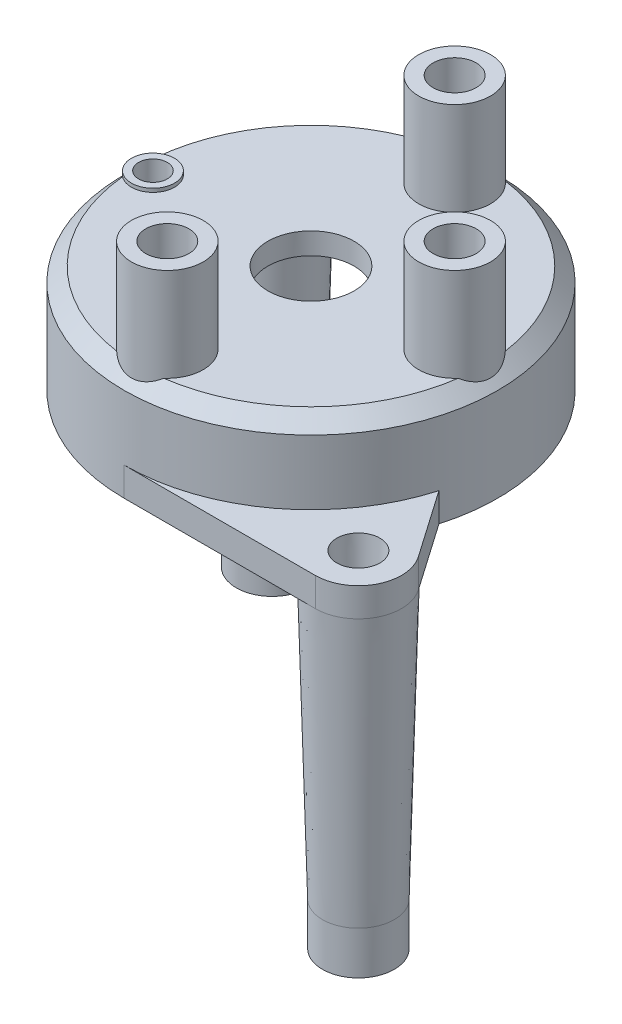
ISO-10303-21;
HEADER;
FILE_DESCRIPTION(('STEP AP214'),'2;1');
FILE_NAME('part.step','',(''),(''),'','','');
FILE_SCHEMA(('AUTOMOTIVE_DESIGN { 1 0 10303 214 1 1 1 1 }'));
ENDSEC;
DATA;
#1=APPLICATION_CONTEXT('core data for automotive mechanical design processes');
#2=APPLICATION_PROTOCOL_DEFINITION('international standard','automotive_design',2000,#1);
#3=PRODUCT_CONTEXT('',#1,'mechanical');
#4=PRODUCT('Part','Part','',(#3));
#5=PRODUCT_RELATED_PRODUCT_CATEGORY('part','',(#4));
#6=PRODUCT_DEFINITION_FORMATION('','',#4);
#7=PRODUCT_DEFINITION_CONTEXT('part definition',#1,'design');
#8=PRODUCT_DEFINITION('design','',#6,#7);
#9=PRODUCT_DEFINITION_SHAPE('','',#8);
#10=(LENGTH_UNIT() NAMED_UNIT(*) SI_UNIT(.MILLI.,.METRE.));
#11=(NAMED_UNIT(*) PLANE_ANGLE_UNIT() SI_UNIT($,.RADIAN.));
#12=(NAMED_UNIT(*) SI_UNIT($,.STERADIAN.) SOLID_ANGLE_UNIT());
#13=UNCERTAINTY_MEASURE_WITH_UNIT(LENGTH_MEASURE(1.E-05),#10,'distance_accuracy_value','');
#14=(GEOMETRIC_REPRESENTATION_CONTEXT(3) GLOBAL_UNCERTAINTY_ASSIGNED_CONTEXT((#13)) GLOBAL_UNIT_ASSIGNED_CONTEXT((#10,
#11,#12)) REPRESENTATION_CONTEXT('',''));
#15=CARTESIAN_POINT('',(0.,0.,0.));
#16=DIRECTION('',(0.,0.,1.));
#17=DIRECTION('',(1.,0.,0.));
#18=AXIS2_PLACEMENT_3D('',#15,#16,#17);
#19=CARTESIAN_POINT('',(0.321544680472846,-2.,-32.4831215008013));
#20=DIRECTION('',(0.,-1.,0.));
#21=DIRECTION('',(0.,0.,-1.));
#22=AXIS2_PLACEMENT_3D('',#19,#20,#21);
#23=PLANE('',#22);
#24=CARTESIAN_POINT('',(0.,-2.,0.));
#25=DIRECTION('',(0.,-1.,0.));
#26=DIRECTION('',(0.,0.,-1.));
#27=AXIS2_PLACEMENT_3D('',#24,#25,#26);
#28=CIRCLE('',#27,12.);
#29=CARTESIAN_POINT('',(0.,-2.,-12.));
#30=VERTEX_POINT('',#29);
#31=EDGE_CURVE('E146',#30,#30,#28,.T.);
#32=ORIENTED_EDGE('',*,*,#31,.F.);
#33=EDGE_LOOP('',(#32));
#34=FACE_BOUND('',#33,.T.);
#35=DIRECTION('',(-0.529109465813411,0.,-0.848553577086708));
#36=VECTOR('',#35,1.);
#37=CARTESIAN_POINT('',(-21.6946112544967,-2.,-18.7551061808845));
#38=LINE('',#37,#36);
#39=CARTESIAN_POINT('',(-12.4114396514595,-2.,-3.86732023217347));
#40=VERTEX_POINT('',#39);
#41=CARTESIAN_POINT('',(-15.2456607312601,-2.,-8.41267160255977));
#42=VERTEX_POINT('',#41);
#43=EDGE_CURVE('E174',#40,#42,#38,.T.);
#44=ORIENTED_EDGE('',*,*,#43,.T.);
#45=CARTESIAN_POINT('',(-12.7,-2.,-10.));
#46=DIRECTION('',(0.,-1.,0.));
#47=DIRECTION('',(0.,0.,-1.));
#48=AXIS2_PLACEMENT_3D('',#45,#46,#47);
#49=CIRCLE('',#48,2.9999999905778);
#50=CARTESIAN_POINT('',(-12.7,-2.,-12.9999999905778));
#51=VERTEX_POINT('',#50);
#52=EDGE_CURVE('E138',#51,#42,#49,.T.);
#53=ORIENTED_EDGE('',*,*,#52,.F.);
#54=DIRECTION('',(-1.,0.,0.));
#55=VECTOR('',#54,1.);
#56=CARTESIAN_POINT('',(0.321544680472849,-2.,-13.));
#57=LINE('',#56,#55);
#58=CARTESIAN_POINT('',(0.,-2.,-13.));
#59=VERTEX_POINT('',#58);
#60=EDGE_CURVE('E179',#59,#51,#57,.T.);
#61=ORIENTED_EDGE('',*,*,#60,.F.);
#62=CARTESIAN_POINT('',(0.,-2.,0.));
#63=DIRECTION('',(0.,-1.,0.));
#64=DIRECTION('',(0.,0.,-1.));
#65=AXIS2_PLACEMENT_3D('',#62,#63,#64);
#66=CIRCLE('',#65,13.);
#67=CARTESIAN_POINT('',(12.4950715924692,-2.,3.58792222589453));
#68=VERTEX_POINT('',#67);
#69=EDGE_CURVE('E176',#59,#68,#66,.T.);
#70=ORIENTED_EDGE('',*,*,#69,.T.);
#71=DIRECTION('',(0.570929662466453,0.,0.820998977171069));
#72=VECTOR('',#71,1.);
#73=CARTESIAN_POINT('',(-8.38069610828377,-2.,-26.4315093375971));
#74=LINE('',#73,#72);
#75=CARTESIAN_POINT('',(15.7629967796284,-2.,8.28721111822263));
#76=VERTEX_POINT('',#75);
#77=EDGE_CURVE('E525',#68,#76,#74,.T.);
#78=ORIENTED_EDGE('',*,*,#77,.T.);
#79=CARTESIAN_POINT('',(13.3,-2.,10.));
#80=DIRECTION('',(0.,-1.,0.));
#81=DIRECTION('',(0.,0.,-1.));
#82=AXIS2_PLACEMENT_3D('',#79,#80,#81);
#83=CIRCLE('',#82,2.999999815);
#84=CARTESIAN_POINT('',(13.3,-2.,13.));
#85=VERTEX_POINT('',#84);
#86=EDGE_CURVE('E288',#85,#76,#83,.T.);
#87=ORIENTED_EDGE('',*,*,#86,.F.);
#88=DIRECTION('',(-1.,0.,0.));
#89=VECTOR('',#88,1.);
#90=CARTESIAN_POINT('',(0.321544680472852,-2.,13.));
#91=LINE('',#90,#89);
#92=CARTESIAN_POINT('',(0.,-2.,13.));
#93=VERTEX_POINT('',#92);
#94=EDGE_CURVE('E175',#85,#93,#91,.T.);
#95=ORIENTED_EDGE('',*,*,#94,.T.);
#96=EDGE_CURVE('E172',#93,#40,#66,.T.);
#97=ORIENTED_EDGE('',*,*,#96,.T.);
#98=EDGE_LOOP('',(#44,#53,#61,#70,#78,#87,#95,#97));
#99=FACE_BOUND('',#98,.T.);
#100=ADVANCED_FACE('F28',(#34,#99),#23,.T.);
#101=CARTESIAN_POINT('',(0.,0.,-10.));
#102=DIRECTION('',(0.,1.,0.));
#103=DIRECTION('',(0.,0.,1.));
#104=AXIS2_PLACEMENT_3D('',#101,#102,#103);
#105=CYLINDRICAL_SURFACE('',#104,1.5);
#106=CARTESIAN_POINT('',(0.,12.,-10.));
#107=DIRECTION('',(0.,1.,0.));
#108=DIRECTION('',(0.,0.,1.));
#109=AXIS2_PLACEMENT_3D('',#106,#107,#108);
#110=CIRCLE('',#109,1.5);
#111=CARTESIAN_POINT('',(0.,12.,-8.5));
#112=VERTEX_POINT('',#111);
#113=EDGE_CURVE('E199',#112,#112,#110,.T.);
#114=ORIENTED_EDGE('',*,*,#113,.T.);
#115=EDGE_LOOP('',(#114));
#116=FACE_BOUND('',#115,.T.);
#117=CARTESIAN_POINT('',(0.,4.,-10.));
#118=DIRECTION('',(0.,-1.,0.));
#119=DIRECTION('',(0.,0.,-1.));
#120=AXIS2_PLACEMENT_3D('',#117,#118,#119);
#121=CIRCLE('',#120,1.5);
#122=CARTESIAN_POINT('',(0.,4.,-11.5));
#123=VERTEX_POINT('',#122);
#124=EDGE_CURVE('E160',#123,#123,#121,.F.);
#125=ORIENTED_EDGE('',*,*,#124,.F.);
#126=EDGE_LOOP('',(#125));
#127=FACE_BOUND('',#126,.T.);
#128=ADVANCED_FACE('F300',(#116,#127),#105,.F.);
#129=CARTESIAN_POINT('',(10.,0.,0.));
#130=DIRECTION('',(0.,1.,0.));
#131=DIRECTION('',(0.,0.,1.));
#132=AXIS2_PLACEMENT_3D('',#129,#130,#131);
#133=CYLINDRICAL_SURFACE('',#132,1.5);
#134=CARTESIAN_POINT('',(10.,12.,0.));
#135=DIRECTION('',(0.,1.,0.));
#136=DIRECTION('',(0.,0.,1.));
#137=AXIS2_PLACEMENT_3D('',#134,#135,#136);
#138=CIRCLE('',#137,1.5);
#139=CARTESIAN_POINT('',(10.,12.,1.50000000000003));
#140=VERTEX_POINT('',#139);
#141=EDGE_CURVE('E196',#140,#140,#138,.T.);
#142=ORIENTED_EDGE('',*,*,#141,.T.);
#143=EDGE_LOOP('',(#142));
#144=FACE_BOUND('',#143,.T.);
#145=CARTESIAN_POINT('',(10.,4.,0.));
#146=DIRECTION('',(0.,-1.,0.));
#147=DIRECTION('',(0.,0.,-1.));
#148=AXIS2_PLACEMENT_3D('',#145,#146,#147);
#149=CIRCLE('',#148,1.5);
#150=CARTESIAN_POINT('',(10.,4.,-1.49999999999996));
#151=VERTEX_POINT('',#150);
#152=EDGE_CURVE('E157',#151,#151,#149,.F.);
#153=ORIENTED_EDGE('',*,*,#152,.F.);
#154=EDGE_LOOP('',(#153));
#155=FACE_BOUND('',#154,.T.);
#156=ADVANCED_FACE('F303',(#144,#155),#133,.F.);
#157=CARTESIAN_POINT('',(0.,0.,10.));
#158=DIRECTION('',(0.,1.,0.));
#159=DIRECTION('',(0.,0.,1.));
#160=AXIS2_PLACEMENT_3D('',#157,#158,#159);
#161=CYLINDRICAL_SURFACE('',#160,1.5);
#162=CARTESIAN_POINT('',(0.,12.,10.));
#163=DIRECTION('',(0.,1.,0.));
#164=DIRECTION('',(0.,0.,1.));
#165=AXIS2_PLACEMENT_3D('',#162,#163,#164);
#166=CIRCLE('',#165,1.5);
#167=CARTESIAN_POINT('',(0.,12.,11.5));
#168=VERTEX_POINT('',#167);
#169=EDGE_CURVE('E193',#168,#168,#166,.T.);
#170=ORIENTED_EDGE('',*,*,#169,.T.);
#171=EDGE_LOOP('',(#170));
#172=FACE_BOUND('',#171,.T.);
#173=CARTESIAN_POINT('',(0.,4.,10.));
#174=DIRECTION('',(0.,-1.,0.));
#175=DIRECTION('',(0.,0.,-1.));
#176=AXIS2_PLACEMENT_3D('',#173,#174,#175);
#177=CIRCLE('',#176,1.5);
#178=CARTESIAN_POINT('',(0.,4.,8.5));
#179=VERTEX_POINT('',#178);
#180=EDGE_CURVE('E154',#179,#179,#177,.F.);
#181=ORIENTED_EDGE('',*,*,#180,.F.);
#182=EDGE_LOOP('',(#181));
#183=FACE_BOUND('',#182,.T.);
#184=ADVANCED_FACE('F307',(#172,#183),#161,.F.);
#185=CARTESIAN_POINT('',(-11.,0.,0.));
#186=DIRECTION('',(0.,1.,0.));
#187=DIRECTION('',(0.,0.,1.));
#188=AXIS2_PLACEMENT_3D('',#185,#186,#187);
#189=CYLINDRICAL_SURFACE('',#188,1.);
#190=CARTESIAN_POINT('',(-11.,5.75,0.));
#191=DIRECTION('',(0.,1.,0.));
#192=DIRECTION('',(0.,0.,1.));
#193=AXIS2_PLACEMENT_3D('',#190,#191,#192);
#194=CIRCLE('',#193,1.);
#195=CARTESIAN_POINT('',(-11.,5.75,1.));
#196=VERTEX_POINT('',#195);
#197=EDGE_CURVE('E191',#196,#196,#194,.T.);
#198=ORIENTED_EDGE('',*,*,#197,.T.);
#199=EDGE_LOOP('',(#198));
#200=FACE_BOUND('',#199,.T.);
#201=CARTESIAN_POINT('',(-11.,4.,0.));
#202=DIRECTION('',(0.,-1.,0.));
#203=DIRECTION('',(0.,0.,-1.));
#204=AXIS2_PLACEMENT_3D('',#201,#202,#203);
#205=CIRCLE('',#204,1.);
#206=CARTESIAN_POINT('',(-12.,4.,0.));
#207=VERTEX_POINT('',#206);
#208=EDGE_CURVE('E151',#207,#207,#205,.F.);
#209=ORIENTED_EDGE('',*,*,#208,.F.);
#210=EDGE_LOOP('',(#209));
#211=FACE_BOUND('',#210,.T.);
#212=ADVANCED_FACE('F311',(#200,#211),#189,.F.);
#213=CARTESIAN_POINT('',(0.,0.,0.));
#214=DIRECTION('',(0.,1.,0.));
#215=DIRECTION('',(0.,0.,1.));
#216=AXIS2_PLACEMENT_3D('',#213,#214,#215);
#217=CYLINDRICAL_SURFACE('',#216,3.);
#218=CARTESIAN_POINT('',(0.,5.5,0.));
#219=DIRECTION('',(0.,1.,0.));
#220=DIRECTION('',(0.,0.,1.));
#221=AXIS2_PLACEMENT_3D('',#218,#219,#220);
#222=CIRCLE('',#221,3.);
#223=CARTESIAN_POINT('',(0.,5.5,3.));
#224=VERTEX_POINT('',#223);
#225=EDGE_CURVE('E188',#224,#224,#222,.T.);
#226=ORIENTED_EDGE('',*,*,#225,.T.);
#227=EDGE_LOOP('',(#226));
#228=FACE_BOUND('',#227,.T.);
#229=CARTESIAN_POINT('',(0.,4.,0.));
#230=DIRECTION('',(0.,-1.,0.));
#231=DIRECTION('',(0.,0.,-1.));
#232=AXIS2_PLACEMENT_3D('',#229,#230,#231);
#233=CIRCLE('',#232,3.);
#234=CARTESIAN_POINT('',(0.,4.,-3.));
#235=VERTEX_POINT('',#234);
#236=EDGE_CURVE('E150',#235,#235,#233,.F.);
#237=ORIENTED_EDGE('',*,*,#236,.F.);
#238=EDGE_LOOP('',(#237));
#239=FACE_BOUND('',#238,.T.);
#240=ADVANCED_FACE('F315',(#228,#239),#217,.F.);
#241=CARTESIAN_POINT('',(0.,5.5,0.));
#242=DIRECTION('',(0.,1.,0.));
#243=DIRECTION('',(0.,0.,1.));
#244=AXIS2_PLACEMENT_3D('',#241,#242,#243);
#245=PLANE('',#244);
#246=ORIENTED_EDGE('',*,*,#225,.F.);
#247=EDGE_LOOP('',(#246));
#248=FACE_BOUND('',#247,.T.);
#249=CARTESIAN_POINT('',(0.,5.5,0.));
#250=DIRECTION('',(0.,1.,0.));
#251=DIRECTION('',(0.,0.,1.));
#252=AXIS2_PLACEMENT_3D('',#249,#250,#251);
#253=CIRCLE('',#252,12.);
#254=CARTESIAN_POINT('',(-1.63931197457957,5.5,-11.8875));
#255=VERTEX_POINT('',#254);
#256=CARTESIAN_POINT('',(-11.9431818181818,5.5,-1.16636531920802));
#257=VERTEX_POINT('',#256);
#258=EDGE_CURVE('E231',#255,#257,#253,.T.);
#259=ORIENTED_EDGE('',*,*,#258,.T.);
#260=CARTESIAN_POINT('',(-11.,5.5,0.));
#261=DIRECTION('',(0.,1.,0.));
#262=DIRECTION('',(0.,0.,1.));
#263=AXIS2_PLACEMENT_3D('',#260,#261,#262);
#264=CIRCLE('',#263,1.5);
#265=CARTESIAN_POINT('',(-11.9431818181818,5.5,1.16636531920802));
#266=VERTEX_POINT('',#265);
#267=EDGE_CURVE('E205',#257,#266,#264,.F.);
#268=ORIENTED_EDGE('',*,*,#267,.T.);
#269=CARTESIAN_POINT('',(-1.63931197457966,5.5,11.8875));
#270=VERTEX_POINT('',#269);
#271=EDGE_CURVE('E235',#266,#270,#253,.T.);
#272=ORIENTED_EDGE('',*,*,#271,.T.);
#273=CARTESIAN_POINT('',(0.,5.5,10.));
#274=DIRECTION('',(0.,1.,0.));
#275=DIRECTION('',(0.,0.,1.));
#276=AXIS2_PLACEMENT_3D('',#273,#274,#275);
#277=CIRCLE('',#276,2.5);
#278=CARTESIAN_POINT('',(1.63931197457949,5.5,11.8875));
#279=VERTEX_POINT('',#278);
#280=EDGE_CURVE('E211',#270,#279,#277,.F.);
#281=ORIENTED_EDGE('',*,*,#280,.T.);
#282=CARTESIAN_POINT('',(11.8875,5.5,1.63931197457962));
#283=VERTEX_POINT('',#282);
#284=EDGE_CURVE('E576',#279,#283,#253,.T.);
#285=ORIENTED_EDGE('',*,*,#284,.T.);
#286=CARTESIAN_POINT('',(10.,5.5,0.));
#287=DIRECTION('',(0.,1.,0.));
#288=DIRECTION('',(0.,0.,1.));
#289=AXIS2_PLACEMENT_3D('',#286,#287,#288);
#290=CIRCLE('',#289,2.5);
#291=CARTESIAN_POINT('',(11.8875,5.5,-1.63931197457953));
#292=VERTEX_POINT('',#291);
#293=EDGE_CURVE('E217',#283,#292,#290,.F.);
#294=ORIENTED_EDGE('',*,*,#293,.T.);
#295=CARTESIAN_POINT('',(1.63931197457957,5.5,-11.8875));
#296=VERTEX_POINT('',#295);
#297=EDGE_CURVE('E229',#292,#296,#253,.T.);
#298=ORIENTED_EDGE('',*,*,#297,.T.);
#299=CARTESIAN_POINT('',(0.,5.5,-10.));
#300=DIRECTION('',(0.,1.,0.));
#301=DIRECTION('',(0.,0.,1.));
#302=AXIS2_PLACEMENT_3D('',#299,#300,#301);
#303=CIRCLE('',#302,2.5);
#304=EDGE_CURVE('E223',#296,#255,#303,.F.);
#305=ORIENTED_EDGE('',*,*,#304,.T.);
#306=EDGE_LOOP('',(#259,#268,#272,#281,#285,#294,#298,#305));
#307=FACE_BOUND('',#306,.T.);
#308=ADVANCED_FACE('F30',(#248,#307),#245,.T.);
#309=CARTESIAN_POINT('',(0.,4.50000000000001,0.));
#310=DIRECTION('',(0.,-1.,0.));
#311=DIRECTION('',(0.,0.,-1.));
#312=AXIS2_PLACEMENT_3D('',#309,#310,#311);
#313=CONICAL_SURFACE('',#312,13.,0.785398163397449);
#314=CARTESIAN_POINT('',(0.,4.50000000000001,0.));
#315=DIRECTION('',(0.,1.,0.));
#316=DIRECTION('',(0.,0.,1.));
#317=AXIS2_PLACEMENT_3D('',#314,#315,#316);
#318=CIRCLE('',#317,13.);
#319=CARTESIAN_POINT('',(0.,4.50000000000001,13.));
#320=VERTEX_POINT('',#319);
#321=EDGE_CURVE('E226',#320,#320,#318,.F.);
#322=ORIENTED_EDGE('',*,*,#321,.F.);
#323=EDGE_LOOP('',(#322));
#324=FACE_BOUND('',#323,.T.);
#325=ORIENTED_EDGE('',*,*,#271,.F.);
#326=CARTESIAN_POINT('',(-11.9429636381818,5.5002,1.1665417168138));
#327=CARTESIAN_POINT('',(-12.0011356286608,5.44686224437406,1.11954820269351));
#328=CARTESIAN_POINT('',(-12.0573373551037,5.39571185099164,1.06688408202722));
#329=CARTESIAN_POINT('',(-12.1636178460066,5.2995143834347,0.949885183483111));
#330=CARTESIAN_POINT('',(-12.2136437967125,5.25451963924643,0.885460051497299));
#331=CARTESIAN_POINT('',(-12.2954715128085,5.18125581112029,0.75911008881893));
#332=CARTESIAN_POINT('',(-12.3289231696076,5.15143718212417,0.699174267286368));
#333=CARTESIAN_POINT('',(-12.388039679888,5.09888877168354,0.572876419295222));
#334=CARTESIAN_POINT('',(-12.413726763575,5.07613874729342,0.506533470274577));
#335=CARTESIAN_POINT('',(-12.4559499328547,5.03881002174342,0.368084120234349));
#336=CARTESIAN_POINT('',(-12.4724052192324,5.02430345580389,0.295932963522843));
#337=CARTESIAN_POINT('',(-12.4944631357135,5.00486941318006,0.14869291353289));
#338=CARTESIAN_POINT('',(-12.5000676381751,4.99994028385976,0.0736045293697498));
#339=CARTESIAN_POINT('',(-12.4999397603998,5.00005318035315,-0.0668397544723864));
#340=CARTESIAN_POINT('',(-12.4955737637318,5.00389342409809,-0.13220433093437));
#341=CARTESIAN_POINT('',(-12.4785523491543,5.01888597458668,-0.260954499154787));
#342=CARTESIAN_POINT('',(-12.4658990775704,5.03003638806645,-0.324340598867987));
#343=CARTESIAN_POINT('',(-12.4333022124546,5.05882439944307,-0.446783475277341));
#344=CARTESIAN_POINT('',(-12.4134465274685,5.07638378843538,-0.505882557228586));
#345=CARTESIAN_POINT('',(-12.3674682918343,5.11716035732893,-0.619511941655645));
#346=CARTESIAN_POINT('',(-12.3413409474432,5.1403818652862,-0.67403870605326));
#347=CARTESIAN_POINT('',(-12.2726876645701,5.20161018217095,-0.798166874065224));
#348=CARTESIAN_POINT('',(-12.227743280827,5.2418487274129,-0.8653329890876));
#349=CARTESIAN_POINT('',(-12.1306156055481,5.32932013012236,-0.988890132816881));
#350=CARTESIAN_POINT('',(-12.0784281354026,5.37655702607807,-1.04527489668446));
#351=CARTESIAN_POINT('',(-11.997352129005,5.45042157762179,-1.12097633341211));
#352=CARTESIAN_POINT('',(-11.9703877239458,5.47505939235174,-1.14437194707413));
#353=CARTESIAN_POINT('',(-11.9429636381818,5.5002,-1.16654171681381));
#354=B_SPLINE_CURVE_WITH_KNOTS('',3,(#326,#327,#328,#329,#330,#331,#332,#333,#334,#335,#336,
#337,#338,#339,#340,#341,#342,#343,#344,#345,#346,#347,#348,#349,#350,#351,#352,#353),
.UNSPECIFIED.,.F.,.F.,(4,2,2,2,2,2,2,2,2,2,2,2,2,4),(0.,0.275959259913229,0.554135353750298,
0.777738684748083,1.00069563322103,1.22557467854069,1.45041491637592,1.64631462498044,
1.84216361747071,2.03569847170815,2.22938172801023,2.49874850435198,2.76827133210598,
2.89827049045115),.UNSPECIFIED.);
#355=EDGE_CURVE('E282',#266,#257,#354,.T.);
#356=ORIENTED_EDGE('',*,*,#355,.T.);
#357=ORIENTED_EDGE('',*,*,#258,.F.);
#358=CARTESIAN_POINT('',(-1.63958826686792,5.5002,-11.887260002));
#359=CARTESIAN_POINT('',(-1.59621088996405,5.46879855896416,-11.9249406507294));
#360=CARTESIAN_POINT('',(-1.55111146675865,5.43845625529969,-11.9614992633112));
#361=CARTESIAN_POINT('',(-1.45745940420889,5.38009839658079,-12.0320582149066));
#362=CARTESIAN_POINT('',(-1.40890375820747,5.35208491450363,-12.0660562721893));
#363=CARTESIAN_POINT('',(-1.25756913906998,5.27161836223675,-12.1640215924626));
#364=CARTESIAN_POINT('',(-1.14963184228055,5.22311326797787,-12.2235096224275));
#365=CARTESIAN_POINT('',(-0.921329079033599,5.13874775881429,-12.3274376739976));
#366=CARTESIAN_POINT('',(-0.800900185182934,5.1029564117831,-12.3717954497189));
#367=CARTESIAN_POINT('',(-0.551658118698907,5.0466242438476,-12.4417880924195));
#368=CARTESIAN_POINT('',(-0.42287475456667,5.02603213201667,-12.4674859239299));
#369=CARTESIAN_POINT('',(-0.175639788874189,5.00272910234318,-12.4965831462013));
#370=CARTESIAN_POINT('',(-0.0575961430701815,4.99831074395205,-12.5021115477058));
#371=CARTESIAN_POINT('',(0.177889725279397,5.00284709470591,-12.4964411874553));
#372=CARTESIAN_POINT('',(0.29533170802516,5.01180677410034,-12.4852362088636));
#373=CARTESIAN_POINT('',(0.518343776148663,5.04156661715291,-12.4481182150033));
#374=CARTESIAN_POINT('',(0.624191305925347,5.06156696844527,-12.4231990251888));
#375=CARTESIAN_POINT('',(0.829537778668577,5.11183306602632,-12.3608026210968));
#376=CARTESIAN_POINT('',(0.929034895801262,5.14210174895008,-12.3233218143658));
#377=CARTESIAN_POINT('',(1.12639245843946,5.21404308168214,-12.2346679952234));
#378=CARTESIAN_POINT('',(1.22367251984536,5.25635554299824,-12.1827321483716));
#379=CARTESIAN_POINT('',(1.40751586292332,5.349638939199,-12.0689554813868));
#380=CARTESIAN_POINT('',(1.49408866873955,5.40060208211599,-12.0071235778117));
#381=CARTESIAN_POINT('',(1.59696050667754,5.46988410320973,-11.923673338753));
#382=CARTESIAN_POINT('',(1.6184849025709,5.48491981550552,-11.9055956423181));
#383=CARTESIAN_POINT('',(1.63958826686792,5.5002,-11.887260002));
#384=B_SPLINE_CURVE_WITH_KNOTS('',3,(#358,#359,#360,#361,#362,#363,#364,#365,#366,#367,#368,
#369,#370,#371,#372,#373,#374,#375,#376,#377,#378,#379,#380,#381,#382,#383),.UNSPECIFIED.,.F.,
.F.,(4,2,2,2,2,2,2,2,2,2,2,2,4),(0.,0.196358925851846,0.392890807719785,0.788258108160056,
1.18574153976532,1.58187742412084,1.93474438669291,2.28774248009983,2.61800406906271,
2.94836018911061,3.30137612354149,3.65407575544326,3.74968333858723),.UNSPECIFIED.);
#385=EDGE_CURVE('E234',#255,#296,#384,.T.);
#386=ORIENTED_EDGE('',*,*,#385,.T.);
#387=ORIENTED_EDGE('',*,*,#297,.F.);
#388=CARTESIAN_POINT('',(11.887260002,5.5002,-1.63958826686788));
#389=CARTESIAN_POINT('',(11.9249406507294,5.46879855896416,-1.59621088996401));
#390=CARTESIAN_POINT('',(11.9614992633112,5.43845625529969,-1.55111146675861));
#391=CARTESIAN_POINT('',(12.0320582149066,5.38009839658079,-1.45745940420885));
#392=CARTESIAN_POINT('',(12.0660562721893,5.35208491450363,-1.40890375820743));
#393=CARTESIAN_POINT('',(12.1640215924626,5.27161836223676,-1.25756913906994));
#394=CARTESIAN_POINT('',(12.2235096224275,5.22311326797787,-1.1496318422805));
#395=CARTESIAN_POINT('',(12.3274376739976,5.13874775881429,-0.921329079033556));
#396=CARTESIAN_POINT('',(12.3717954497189,5.1029564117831,-0.800900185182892));
#397=CARTESIAN_POINT('',(12.4417880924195,5.0466242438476,-0.551658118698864));
#398=CARTESIAN_POINT('',(12.4674859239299,5.02603213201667,-0.422874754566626));
#399=CARTESIAN_POINT('',(12.4965831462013,5.00272910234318,-0.175639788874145));
#400=CARTESIAN_POINT('',(12.5021115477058,4.99831074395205,-0.0575961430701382));
#401=CARTESIAN_POINT('',(12.4964411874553,5.00284709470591,0.177889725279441));
#402=CARTESIAN_POINT('',(12.4852362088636,5.01180677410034,0.295331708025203));
#403=CARTESIAN_POINT('',(12.4481182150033,5.0415666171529,0.518343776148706));
#404=CARTESIAN_POINT('',(12.4231990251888,5.06156696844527,0.624191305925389));
#405=CARTESIAN_POINT('',(12.3608026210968,5.11183306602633,0.829537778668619));
#406=CARTESIAN_POINT('',(12.3233218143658,5.14210174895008,0.929034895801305));
#407=CARTESIAN_POINT('',(12.2346679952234,5.21404308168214,1.1263924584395));
#408=CARTESIAN_POINT('',(12.1827321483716,5.25635554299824,1.2236725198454));
#409=CARTESIAN_POINT('',(12.0689554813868,5.349638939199,1.40751586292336));
#410=CARTESIAN_POINT('',(12.0071235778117,5.40060208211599,1.4940886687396));
#411=CARTESIAN_POINT('',(11.923673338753,5.46988410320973,1.59696050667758));
#412=CARTESIAN_POINT('',(11.9055956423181,5.48491981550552,1.61848490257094));
#413=CARTESIAN_POINT('',(11.887260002,5.5002,1.63958826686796));
#414=B_SPLINE_CURVE_WITH_KNOTS('',3,(#388,#389,#390,#391,#392,#393,#394,#395,#396,#397,#398,
#399,#400,#401,#402,#403,#404,#405,#406,#407,#408,#409,#410,#411,#412,#413),.UNSPECIFIED.,.F.,
.F.,(4,2,2,2,2,2,2,2,2,2,2,2,4),(0.,0.196358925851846,0.392890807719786,0.788258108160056,
1.18574153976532,1.58187742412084,1.93474438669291,2.28774248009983,2.61800406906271,
2.94836018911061,3.30137612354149,3.65407575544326,3.74968333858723),.UNSPECIFIED.);
#415=EDGE_CURVE('E243',#292,#283,#414,.T.);
#416=ORIENTED_EDGE('',*,*,#415,.T.);
#417=ORIENTED_EDGE('',*,*,#284,.F.);
#418=CARTESIAN_POINT('',(1.63958826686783,5.5002,11.887260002));
#419=CARTESIAN_POINT('',(1.59621088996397,5.46879855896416,11.9249406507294));
#420=CARTESIAN_POINT('',(1.55111146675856,5.43845625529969,11.9614992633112));
#421=CARTESIAN_POINT('',(1.45745940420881,5.38009839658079,12.0320582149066));
#422=CARTESIAN_POINT('',(1.40890375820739,5.35208491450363,12.0660562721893));
#423=CARTESIAN_POINT('',(1.2575691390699,5.27161836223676,12.1640215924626));
#424=CARTESIAN_POINT('',(1.14963184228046,5.22311326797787,12.2235096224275));
#425=CARTESIAN_POINT('',(0.921329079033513,5.13874775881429,12.3274376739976));
#426=CARTESIAN_POINT('',(0.800900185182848,5.1029564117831,12.3717954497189));
#427=CARTESIAN_POINT('',(0.551658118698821,5.0466242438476,12.4417880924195));
#428=CARTESIAN_POINT('',(0.422874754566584,5.02603213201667,12.4674859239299));
#429=CARTESIAN_POINT('',(0.175639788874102,5.00272910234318,12.4965831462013));
#430=CARTESIAN_POINT('',(0.0575961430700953,4.99831074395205,12.5021115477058));
#431=CARTESIAN_POINT('',(-0.177889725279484,5.00284709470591,12.4964411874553));
#432=CARTESIAN_POINT('',(-0.295331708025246,5.01180677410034,12.4852362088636));
#433=CARTESIAN_POINT('',(-0.51834377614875,5.04156661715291,12.4481182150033));
#434=CARTESIAN_POINT('',(-0.624191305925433,5.06156696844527,12.4231990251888));
#435=CARTESIAN_POINT('',(-0.829537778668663,5.11183306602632,12.3608026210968));
#436=CARTESIAN_POINT('',(-0.929034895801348,5.14210174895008,12.3233218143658));
#437=CARTESIAN_POINT('',(-1.12639245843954,5.21404308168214,12.2346679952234));
#438=CARTESIAN_POINT('',(-1.22367251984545,5.25635554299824,12.1827321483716));
#439=CARTESIAN_POINT('',(-1.40751586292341,5.349638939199,12.0689554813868));
#440=CARTESIAN_POINT('',(-1.49408866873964,5.40060208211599,12.0071235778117));
#441=CARTESIAN_POINT('',(-1.59696050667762,5.46988410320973,11.923673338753));
#442=CARTESIAN_POINT('',(-1.61848490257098,5.48491981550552,11.9055956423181));
#443=CARTESIAN_POINT('',(-1.639588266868,5.5002,11.887260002));
#444=B_SPLINE_CURVE_WITH_KNOTS('',3,(#418,#419,#420,#421,#422,#423,#424,#425,#426,#427,#428,
#429,#430,#431,#432,#433,#434,#435,#436,#437,#438,#439,#440,#441,#442,#443),.UNSPECIFIED.,.F.,
.F.,(4,2,2,2,2,2,2,2,2,2,2,2,4),(0.,0.196358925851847,0.392890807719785,0.788258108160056,
1.18574153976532,1.58187742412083,1.93474438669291,2.28774248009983,2.61800406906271,
2.94836018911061,3.30137612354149,3.65407575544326,3.74968333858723),.UNSPECIFIED.);
#445=EDGE_CURVE('E276',#279,#270,#444,.T.);
#446=ORIENTED_EDGE('',*,*,#445,.T.);
#447=EDGE_LOOP('',(#325,#356,#357,#386,#387,#416,#417,#446));
#448=FACE_BOUND('',#447,.T.);
#449=ADVANCED_FACE('F249',(#324,#448),#313,.T.);
#450=CARTESIAN_POINT('',(0.,0.,0.));
#451=DIRECTION('',(0.,-1.,0.));
#452=DIRECTION('',(0.,0.,-1.));
#453=AXIS2_PLACEMENT_3D('',#450,#451,#452);
#454=CYLINDRICAL_SURFACE('',#453,13.);
#455=ORIENTED_EDGE('',*,*,#321,.T.);
#456=EDGE_LOOP('',(#455));
#457=FACE_BOUND('',#456,.T.);
#458=CARTESIAN_POINT('',(0.,0.,0.));
#459=DIRECTION('',(0.,-1.,0.));
#460=DIRECTION('',(0.,0.,-1.));
#461=AXIS2_PLACEMENT_3D('',#458,#459,#460);
#462=CIRCLE('',#461,13.);
#463=CARTESIAN_POINT('',(12.4950715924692,0.,3.58792222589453));
#464=VERTEX_POINT('',#463);
#465=CARTESIAN_POINT('',(0.,0.,13.));
#466=VERTEX_POINT('',#465);
#467=EDGE_CURVE('E230',#464,#466,#462,.T.);
#468=ORIENTED_EDGE('',*,*,#467,.F.);
#469=DIRECTION('',(0.,1.,0.));
#470=VECTOR('',#469,1.);
#471=CARTESIAN_POINT('',(12.4950715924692,-2.,3.58792222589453));
#472=LINE('',#471,#470);
#473=EDGE_CURVE('E501',#68,#464,#472,.T.);
#474=ORIENTED_EDGE('',*,*,#473,.F.);
#475=ORIENTED_EDGE('',*,*,#69,.F.);
#476=DIRECTION('',(0.,1.,0.));
#477=VECTOR('',#476,1.);
#478=CARTESIAN_POINT('',(0.,-2.,-13.));
#479=LINE('',#478,#477);
#480=CARTESIAN_POINT('',(0.,0.,-13.));
#481=VERTEX_POINT('',#480);
#482=EDGE_CURVE('E184',#59,#481,#479,.T.);
#483=ORIENTED_EDGE('',*,*,#482,.T.);
#484=CARTESIAN_POINT('',(-12.4114396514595,0.,-3.86732023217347));
#485=VERTEX_POINT('',#484);
#486=EDGE_CURVE('E48',#485,#481,#462,.T.);
#487=ORIENTED_EDGE('',*,*,#486,.F.);
#488=DIRECTION('',(0.,1.,0.));
#489=VECTOR('',#488,1.);
#490=CARTESIAN_POINT('',(-12.4114396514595,-2.,-3.86732023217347));
#491=LINE('',#490,#489);
#492=EDGE_CURVE('E187',#40,#485,#491,.T.);
#493=ORIENTED_EDGE('',*,*,#492,.F.);
#494=ORIENTED_EDGE('',*,*,#96,.F.);
#495=DIRECTION('',(0.,1.,0.));
#496=VECTOR('',#495,1.);
#497=CARTESIAN_POINT('',(0.,-2.,13.));
#498=LINE('',#497,#496);
#499=EDGE_CURVE('E495',#93,#466,#498,.T.);
#500=ORIENTED_EDGE('',*,*,#499,.T.);
#501=EDGE_LOOP('',(#468,#474,#475,#483,#487,#493,#494,#500));
#502=FACE_BOUND('',#501,.T.);
#503=ADVANCED_FACE('F256',(#457,#502),#454,.T.);
#504=CARTESIAN_POINT('',(0.,12.,-10.));
#505=DIRECTION('',(0.,-1.,0.));
#506=DIRECTION('',(0.,0.,-1.));
#507=AXIS2_PLACEMENT_3D('',#504,#505,#506);
#508=CYLINDRICAL_SURFACE('',#507,2.5);
#509=ORIENTED_EDGE('',*,*,#304,.F.);
#510=ORIENTED_EDGE('',*,*,#385,.F.);
#511=EDGE_LOOP('',(#509,#510));
#512=FACE_BOUND('',#511,.T.);
#513=CARTESIAN_POINT('',(0.,12.,-10.));
#514=DIRECTION('',(0.,1.,0.));
#515=DIRECTION('',(0.,0.,1.));
#516=AXIS2_PLACEMENT_3D('',#513,#514,#515);
#517=CIRCLE('',#516,2.5);
#518=CARTESIAN_POINT('',(0.,12.,-7.5));
#519=VERTEX_POINT('',#518);
#520=EDGE_CURVE('E220',#519,#519,#517,.T.);
#521=ORIENTED_EDGE('',*,*,#520,.F.);
#522=EDGE_LOOP('',(#521));
#523=FACE_BOUND('',#522,.T.);
#524=ADVANCED_FACE('F251',(#512,#523),#508,.T.);
#525=CARTESIAN_POINT('',(0.,12.,-10.));
#526=DIRECTION('',(0.,1.,0.));
#527=DIRECTION('',(0.,0.,1.));
#528=AXIS2_PLACEMENT_3D('',#525,#526,#527);
#529=PLANE('',#528);
#530=ORIENTED_EDGE('',*,*,#113,.F.);
#531=EDGE_LOOP('',(#530));
#532=FACE_BOUND('',#531,.T.);
#533=ORIENTED_EDGE('',*,*,#520,.T.);
#534=EDGE_LOOP('',(#533));
#535=FACE_BOUND('',#534,.T.);
#536=ADVANCED_FACE('F255',(#532,#535),#529,.T.);
#537=CARTESIAN_POINT('',(10.,12.,0.));
#538=DIRECTION('',(0.,-1.,0.));
#539=DIRECTION('',(0.,0.,-1.));
#540=AXIS2_PLACEMENT_3D('',#537,#538,#539);
#541=CYLINDRICAL_SURFACE('',#540,2.5);
#542=ORIENTED_EDGE('',*,*,#293,.F.);
#543=ORIENTED_EDGE('',*,*,#415,.F.);
#544=EDGE_LOOP('',(#542,#543));
#545=FACE_BOUND('',#544,.T.);
#546=CARTESIAN_POINT('',(10.,12.,0.));
#547=DIRECTION('',(0.,1.,0.));
#548=DIRECTION('',(0.,0.,1.));
#549=AXIS2_PLACEMENT_3D('',#546,#547,#548);
#550=CIRCLE('',#549,2.5);
#551=CARTESIAN_POINT('',(10.,12.,2.50000000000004));
#552=VERTEX_POINT('',#551);
#553=EDGE_CURVE('E214',#552,#552,#550,.T.);
#554=ORIENTED_EDGE('',*,*,#553,.F.);
#555=EDGE_LOOP('',(#554));
#556=FACE_BOUND('',#555,.T.);
#557=ADVANCED_FACE('F259',(#545,#556),#541,.T.);
#558=CARTESIAN_POINT('',(10.,12.,0.));
#559=DIRECTION('',(0.,1.,0.));
#560=DIRECTION('',(0.,0.,1.));
#561=AXIS2_PLACEMENT_3D('',#558,#559,#560);
#562=PLANE('',#561);
#563=ORIENTED_EDGE('',*,*,#141,.F.);
#564=EDGE_LOOP('',(#563));
#565=FACE_BOUND('',#564,.T.);
#566=ORIENTED_EDGE('',*,*,#553,.T.);
#567=EDGE_LOOP('',(#566));
#568=FACE_BOUND('',#567,.T.);
#569=ADVANCED_FACE('F264',(#565,#568),#562,.T.);
#570=CARTESIAN_POINT('',(0.,12.,10.));
#571=DIRECTION('',(0.,-1.,0.));
#572=DIRECTION('',(0.,0.,-1.));
#573=AXIS2_PLACEMENT_3D('',#570,#571,#572);
#574=CYLINDRICAL_SURFACE('',#573,2.5);
#575=ORIENTED_EDGE('',*,*,#280,.F.);
#576=ORIENTED_EDGE('',*,*,#445,.F.);
#577=EDGE_LOOP('',(#575,#576));
#578=FACE_BOUND('',#577,.T.);
#579=CARTESIAN_POINT('',(0.,12.,10.));
#580=DIRECTION('',(0.,1.,0.));
#581=DIRECTION('',(0.,0.,1.));
#582=AXIS2_PLACEMENT_3D('',#579,#580,#581);
#583=CIRCLE('',#582,2.5);
#584=CARTESIAN_POINT('',(0.,12.,12.5));
#585=VERTEX_POINT('',#584);
#586=EDGE_CURVE('E208',#585,#585,#583,.T.);
#587=ORIENTED_EDGE('',*,*,#586,.F.);
#588=EDGE_LOOP('',(#587));
#589=FACE_BOUND('',#588,.T.);
#590=ADVANCED_FACE('F268',(#578,#589),#574,.T.);
#591=CARTESIAN_POINT('',(0.,12.,10.));
#592=DIRECTION('',(0.,1.,0.));
#593=DIRECTION('',(0.,0.,1.));
#594=AXIS2_PLACEMENT_3D('',#591,#592,#593);
#595=PLANE('',#594);
#596=ORIENTED_EDGE('',*,*,#169,.F.);
#597=EDGE_LOOP('',(#596));
#598=FACE_BOUND('',#597,.T.);
#599=ORIENTED_EDGE('',*,*,#586,.T.);
#600=EDGE_LOOP('',(#599));
#601=FACE_BOUND('',#600,.T.);
#602=ADVANCED_FACE('F273',(#598,#601),#595,.T.);
#603=CARTESIAN_POINT('',(-11.,5.75,0.));
#604=DIRECTION('',(0.,-1.,0.));
#605=DIRECTION('',(0.,0.,-1.));
#606=AXIS2_PLACEMENT_3D('',#603,#604,#605);
#607=CYLINDRICAL_SURFACE('',#606,1.5);
#608=ORIENTED_EDGE('',*,*,#267,.F.);
#609=ORIENTED_EDGE('',*,*,#355,.F.);
#610=EDGE_LOOP('',(#608,#609));
#611=FACE_BOUND('',#610,.T.);
#612=CARTESIAN_POINT('',(-11.,5.75,0.));
#613=DIRECTION('',(0.,1.,0.));
#614=DIRECTION('',(0.,0.,1.));
#615=AXIS2_PLACEMENT_3D('',#612,#613,#614);
#616=CIRCLE('',#615,1.5);
#617=CARTESIAN_POINT('',(-11.,5.75,1.5));
#618=VERTEX_POINT('',#617);
#619=EDGE_CURVE('E202',#618,#618,#616,.T.);
#620=ORIENTED_EDGE('',*,*,#619,.F.);
#621=EDGE_LOOP('',(#620));
#622=FACE_BOUND('',#621,.T.);
#623=ADVANCED_FACE('F290',(#611,#622),#607,.T.);
#624=CARTESIAN_POINT('',(-11.,5.75,0.));
#625=DIRECTION('',(0.,1.,0.));
#626=DIRECTION('',(0.,0.,1.));
#627=AXIS2_PLACEMENT_3D('',#624,#625,#626);
#628=PLANE('',#627);
#629=ORIENTED_EDGE('',*,*,#197,.F.);
#630=EDGE_LOOP('',(#629));
#631=FACE_BOUND('',#630,.T.);
#632=ORIENTED_EDGE('',*,*,#619,.T.);
#633=EDGE_LOOP('',(#632));
#634=FACE_BOUND('',#633,.T.);
#635=ADVANCED_FACE('F294',(#631,#634),#628,.T.);
#636=CARTESIAN_POINT('',(0.321544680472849,-2.,-13.));
#637=DIRECTION('',(0.,0.,-1.));
#638=DIRECTION('',(-1.,0.,0.));
#639=AXIS2_PLACEMENT_3D('',#636,#637,#638);
#640=PLANE('',#639);
#641=DIRECTION('',(-1.,0.,0.));
#642=VECTOR('',#641,1.);
#643=CARTESIAN_POINT('',(0.321544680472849,0.,-13.));
#644=LINE('',#643,#642);
#645=CARTESIAN_POINT('',(-12.7,0.,-13.));
#646=VERTEX_POINT('',#645);
#647=EDGE_CURVE('E170',#481,#646,#644,.T.);
#648=ORIENTED_EDGE('',*,*,#647,.F.);
#649=ORIENTED_EDGE('',*,*,#482,.F.);
#650=ORIENTED_EDGE('',*,*,#60,.T.);
#651=DIRECTION('',(0.,1.,0.));
#652=VECTOR('',#651,1.);
#653=CARTESIAN_POINT('',(-12.7,-2.,-13.));
#654=LINE('',#653,#652);
#655=EDGE_CURVE('E181',#51,#646,#654,.T.);
#656=ORIENTED_EDGE('',*,*,#655,.T.);
#657=EDGE_LOOP('',(#648,#649,#650,#656));
#658=FACE_BOUND('',#657,.T.);
#659=ADVANCED_FACE('F298',(#658),#640,.T.);
#660=CARTESIAN_POINT('',(-12.7,-2.,-10.));
#661=DIRECTION('',(0.,1.,0.));
#662=DIRECTION('',(0.,0.,1.));
#663=AXIS2_PLACEMENT_3D('',#660,#661,#662);
#664=CYLINDRICAL_SURFACE('',#663,3.);
#665=ORIENTED_EDGE('',*,*,#655,.F.);
#666=CARTESIAN_POINT('',(-12.7,-1.9999996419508,-10.));
#667=DIRECTION('',(0.,-1.,0.));
#668=DIRECTION('',(0.,0.,-1.));
#669=AXIS2_PLACEMENT_3D('',#666,#667,#668);
#670=CIRCLE('',#669,3.);
#671=EDGE_CURVE('E465',#51,#42,#670,.F.);
#672=ORIENTED_EDGE('',*,*,#671,.T.);
#673=DIRECTION('',(0.,1.,0.));
#674=VECTOR('',#673,1.);
#675=CARTESIAN_POINT('',(-15.2456607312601,-2.,-8.41267160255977));
#676=LINE('',#675,#674);
#677=CARTESIAN_POINT('',(-15.2456607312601,0.,-8.41267160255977));
#678=VERTEX_POINT('',#677);
#679=EDGE_CURVE('E183',#42,#678,#676,.T.);
#680=ORIENTED_EDGE('',*,*,#679,.T.);
#681=CARTESIAN_POINT('',(-12.7,0.,-10.));
#682=DIRECTION('',(0.,-1.,0.));
#683=DIRECTION('',(0.,0.,-1.));
#684=AXIS2_PLACEMENT_3D('',#681,#682,#683);
#685=CIRCLE('',#684,3.);
#686=EDGE_CURVE('E167',#678,#646,#685,.T.);
#687=ORIENTED_EDGE('',*,*,#686,.T.);
#688=EDGE_LOOP('',(#665,#672,#680,#687));
#689=FACE_BOUND('',#688,.T.);
#690=ADVANCED_FACE('F336',(#689),#664,.T.);
#691=CARTESIAN_POINT('',(-21.6946112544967,-2.,-18.7551061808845));
#692=DIRECTION('',(0.848553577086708,0.,-0.529109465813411));
#693=DIRECTION('',(-0.529109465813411,0.,-0.848553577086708));
#694=AXIS2_PLACEMENT_3D('',#691,#692,#693);
#695=PLANE('',#694);
#696=DIRECTION('',(-0.529109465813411,0.,-0.848553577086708));
#697=VECTOR('',#696,1.);
#698=CARTESIAN_POINT('',(-21.6946112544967,0.,-18.7551061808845));
#699=LINE('',#698,#697);
#700=EDGE_CURVE('E171',#485,#678,#699,.T.);
#701=ORIENTED_EDGE('',*,*,#700,.T.);
#702=ORIENTED_EDGE('',*,*,#679,.F.);
#703=ORIENTED_EDGE('',*,*,#43,.F.);
#704=ORIENTED_EDGE('',*,*,#492,.T.);
#705=EDGE_LOOP('',(#701,#702,#703,#704));
#706=FACE_BOUND('',#705,.T.);
#707=ADVANCED_FACE('F332',(#706),#695,.F.);
#708=CARTESIAN_POINT('',(0.321544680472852,-2.,13.));
#709=DIRECTION('',(0.,0.,-1.));
#710=DIRECTION('',(-1.,0.,0.));
#711=AXIS2_PLACEMENT_3D('',#708,#709,#710);
#712=PLANE('',#711);
#713=DIRECTION('',(-1.,0.,0.));
#714=VECTOR('',#713,1.);
#715=CARTESIAN_POINT('',(0.321544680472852,0.,13.));
#716=LINE('',#715,#714);
#717=CARTESIAN_POINT('',(13.3,0.,13.));
#718=VERTEX_POINT('',#717);
#719=EDGE_CURVE('E166',#718,#466,#716,.T.);
#720=ORIENTED_EDGE('',*,*,#719,.T.);
#721=ORIENTED_EDGE('',*,*,#499,.F.);
#722=ORIENTED_EDGE('',*,*,#94,.F.);
#723=DIRECTION('',(0.,1.,0.));
#724=VECTOR('',#723,1.);
#725=CARTESIAN_POINT('',(13.3,-2.,13.));
#726=LINE('',#725,#724);
#727=EDGE_CURVE('E498',#85,#718,#726,.T.);
#728=ORIENTED_EDGE('',*,*,#727,.T.);
#729=EDGE_LOOP('',(#720,#721,#722,#728));
#730=FACE_BOUND('',#729,.T.);
#731=ADVANCED_FACE('F328',(#730),#712,.F.);
#732=CARTESIAN_POINT('',(13.3,-2.,10.));
#733=DIRECTION('',(0.,1.,0.));
#734=DIRECTION('',(0.,0.,1.));
#735=AXIS2_PLACEMENT_3D('',#732,#733,#734);
#736=CYLINDRICAL_SURFACE('',#735,3.);
#737=ORIENTED_EDGE('',*,*,#727,.F.);
#738=CARTESIAN_POINT('',(13.3,-1.99999296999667,10.));
#739=DIRECTION('',(0.,-1.,0.));
#740=DIRECTION('',(0.,0.,-1.));
#741=AXIS2_PLACEMENT_3D('',#738,#739,#740);
#742=CIRCLE('',#741,3.);
#743=EDGE_CURVE('E464',#85,#76,#742,.F.);
#744=ORIENTED_EDGE('',*,*,#743,.T.);
#745=DIRECTION('',(0.,1.,0.));
#746=VECTOR('',#745,1.);
#747=CARTESIAN_POINT('',(15.7629969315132,-2.,8.28721101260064));
#748=LINE('',#747,#746);
#749=CARTESIAN_POINT('',(15.7629969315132,0.,8.28721101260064));
#750=VERTEX_POINT('',#749);
#751=EDGE_CURVE('E192',#76,#750,#748,.T.);
#752=ORIENTED_EDGE('',*,*,#751,.T.);
#753=CARTESIAN_POINT('',(13.3,0.,10.));
#754=DIRECTION('',(0.,-1.,0.));
#755=DIRECTION('',(0.,0.,-1.));
#756=AXIS2_PLACEMENT_3D('',#753,#754,#755);
#757=CIRCLE('',#756,3.);
#758=EDGE_CURVE('E164',#750,#718,#757,.T.);
#759=ORIENTED_EDGE('',*,*,#758,.T.);
#760=EDGE_LOOP('',(#737,#744,#752,#759));
#761=FACE_BOUND('',#760,.T.);
#762=ADVANCED_FACE('F324',(#761),#736,.T.);
#763=CARTESIAN_POINT('',(-8.38069610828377,-2.,-26.4315093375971));
#764=DIRECTION('',(-0.820998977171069,0.,0.570929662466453));
#765=DIRECTION('',(0.570929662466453,0.,0.820998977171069));
#766=AXIS2_PLACEMENT_3D('',#763,#764,#765);
#767=PLANE('',#766);
#768=DIRECTION('',(0.570929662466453,0.,0.820998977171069));
#769=VECTOR('',#768,1.);
#770=CARTESIAN_POINT('',(-8.38069610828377,0.,-26.4315093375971));
#771=LINE('',#770,#769);
#772=EDGE_CURVE('E163',#464,#750,#771,.T.);
#773=ORIENTED_EDGE('',*,*,#772,.T.);
#774=ORIENTED_EDGE('',*,*,#751,.F.);
#775=ORIENTED_EDGE('',*,*,#77,.F.);
#776=ORIENTED_EDGE('',*,*,#473,.T.);
#777=EDGE_LOOP('',(#773,#774,#775,#776));
#778=FACE_BOUND('',#777,.T.);
#779=ADVANCED_FACE('F320',(#778),#767,.F.);
#780=CARTESIAN_POINT('',(0.321544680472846,0.,-32.4831215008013));
#781=DIRECTION('',(0.,-1.,0.));
#782=DIRECTION('',(0.,0.,-1.));
#783=AXIS2_PLACEMENT_3D('',#780,#781,#782);
#784=PLANE('',#783);
#785=CARTESIAN_POINT('',(-12.7,0.,-10.));
#786=DIRECTION('',(0.,-1.,0.));
#787=DIRECTION('',(0.,0.,-1.));
#788=AXIS2_PLACEMENT_3D('',#785,#786,#787);
#789=CIRCLE('',#788,1.49999999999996);
#790=CARTESIAN_POINT('',(-12.7,0.,-11.5));
#791=VERTEX_POINT('',#790);
#792=EDGE_CURVE('E36',#791,#791,#789,.T.);
#793=ORIENTED_EDGE('',*,*,#792,.T.);
#794=EDGE_LOOP('',(#793));
#795=FACE_BOUND('',#794,.T.);
#796=ORIENTED_EDGE('',*,*,#700,.F.);
#797=ORIENTED_EDGE('',*,*,#486,.T.);
#798=ORIENTED_EDGE('',*,*,#647,.T.);
#799=ORIENTED_EDGE('',*,*,#686,.F.);
#800=EDGE_LOOP('',(#796,#797,#798,#799));
#801=FACE_BOUND('',#800,.T.);
#802=ADVANCED_FACE('F323',(#795,#801),#784,.F.);
#803=CARTESIAN_POINT('',(13.3,0.,10.));
#804=DIRECTION('',(0.,-1.,0.));
#805=DIRECTION('',(0.,0.,-1.));
#806=AXIS2_PLACEMENT_3D('',#803,#804,#805);
#807=CIRCLE('',#806,1.49999999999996);
#808=CARTESIAN_POINT('',(13.3,0.,8.50000000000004));
#809=VERTEX_POINT('',#808);
#810=EDGE_CURVE('E11',#809,#809,#807,.T.);
#811=ORIENTED_EDGE('',*,*,#810,.T.);
#812=EDGE_LOOP('',(#811));
#813=FACE_BOUND('',#812,.T.);
#814=ORIENTED_EDGE('',*,*,#772,.F.);
#815=ORIENTED_EDGE('',*,*,#467,.T.);
#816=ORIENTED_EDGE('',*,*,#719,.F.);
#817=ORIENTED_EDGE('',*,*,#758,.F.);
#818=EDGE_LOOP('',(#814,#815,#816,#817));
#819=FACE_BOUND('',#818,.T.);
#820=ADVANCED_FACE('F347',(#813,#819),#784,.F.);
#821=CARTESIAN_POINT('',(0.,4.,0.));
#822=DIRECTION('',(0.,-1.,0.));
#823=DIRECTION('',(0.,0.,-1.));
#824=AXIS2_PLACEMENT_3D('',#821,#822,#823);
#825=PLANE('',#824);
#826=ORIENTED_EDGE('',*,*,#152,.T.);
#827=EDGE_LOOP('',(#826));
#828=FACE_BOUND('',#827,.T.);
#829=CARTESIAN_POINT('',(0.,4.,0.));
#830=DIRECTION('',(0.,-1.,0.));
#831=DIRECTION('',(0.,0.,-1.));
#832=AXIS2_PLACEMENT_3D('',#829,#830,#831);
#833=CIRCLE('',#832,12.);
#834=EDGE_CURVE('E41',#207,#207,#833,.T.);
#835=ORIENTED_EDGE('',*,*,#834,.T.);
#836=ORIENTED_EDGE('',*,*,#208,.T.);
#837=EDGE_LOOP('',(#835,#836));
#838=FACE_BOUND('',#837,.T.);
#839=ORIENTED_EDGE('',*,*,#236,.T.);
#840=EDGE_LOOP('',(#839));
#841=FACE_BOUND('',#840,.T.);
#842=ORIENTED_EDGE('',*,*,#180,.T.);
#843=EDGE_LOOP('',(#842));
#844=FACE_BOUND('',#843,.T.);
#845=ORIENTED_EDGE('',*,*,#124,.T.);
#846=EDGE_LOOP('',(#845));
#847=FACE_BOUND('',#846,.T.);
#848=ADVANCED_FACE('F350',(#828,#838,#841,#844,#847),#825,.T.);
#849=CARTESIAN_POINT('',(0.,4.,0.));
#850=DIRECTION('',(0.,-1.,0.));
#851=DIRECTION('',(0.,0.,-1.));
#852=AXIS2_PLACEMENT_3D('',#849,#850,#851);
#853=CYLINDRICAL_SURFACE('',#852,12.);
#854=ORIENTED_EDGE('',*,*,#834,.F.);
#855=EDGE_LOOP('',(#854));
#856=FACE_BOUND('',#855,.T.);
#857=ORIENTED_EDGE('',*,*,#31,.T.);
#858=EDGE_LOOP('',(#857));
#859=FACE_BOUND('',#858,.T.);
#860=ADVANCED_FACE('F352',(#856,#859),#853,.F.);
#861=CARTESIAN_POINT('',(-12.7,-21.,-10.));
#862=DIRECTION('',(0.,1.,0.));
#863=DIRECTION('',(0.,0.,1.));
#864=AXIS2_PLACEMENT_3D('',#861,#862,#863);
#865=CONICAL_SURFACE('',#864,2.49999999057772,0.0263097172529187);
#866=ORIENTED_EDGE('',*,*,#52,.T.);
#867=ORIENTED_EDGE('',*,*,#671,.F.);
#868=EDGE_LOOP('',(#866,#867));
#869=FACE_BOUND('',#868,.T.);
#870=CARTESIAN_POINT('',(-12.7,-21.,-10.));
#871=DIRECTION('',(0.,-1.,0.));
#872=DIRECTION('',(0.,0.,-1.));
#873=AXIS2_PLACEMENT_3D('',#870,#871,#872);
#874=CIRCLE('',#873,2.49999999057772);
#875=CARTESIAN_POINT('',(-12.7,-21.,-12.4999999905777));
#876=VERTEX_POINT('',#875);
#877=EDGE_CURVE('E470',#876,#876,#874,.T.);
#878=ORIENTED_EDGE('',*,*,#877,.F.);
#879=EDGE_LOOP('',(#878));
#880=FACE_BOUND('',#879,.T.);
#881=ADVANCED_FACE('F355',(#869,#880),#865,.T.);
#882=CARTESIAN_POINT('',(13.3,-21.,10.));
#883=DIRECTION('',(0.,1.,0.));
#884=DIRECTION('',(0.,0.,1.));
#885=AXIS2_PLACEMENT_3D('',#882,#883,#884);
#886=CONICAL_SURFACE('',#885,2.49999981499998,0.0263097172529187);
#887=ORIENTED_EDGE('',*,*,#86,.T.);
#888=ORIENTED_EDGE('',*,*,#743,.F.);
#889=EDGE_LOOP('',(#887,#888));
#890=FACE_BOUND('',#889,.T.);
#891=CARTESIAN_POINT('',(13.3,-21.,10.));
#892=DIRECTION('',(0.,-1.,0.));
#893=DIRECTION('',(0.,0.,-1.));
#894=AXIS2_PLACEMENT_3D('',#891,#892,#893);
#895=CIRCLE('',#894,2.49999981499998);
#896=CARTESIAN_POINT('',(13.3,-21.,7.50000018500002));
#897=VERTEX_POINT('',#896);
#898=EDGE_CURVE('E462',#897,#897,#895,.T.);
#899=ORIENTED_EDGE('',*,*,#898,.F.);
#900=EDGE_LOOP('',(#899));
#901=FACE_BOUND('',#900,.T.);
#902=ADVANCED_FACE('F361',(#890,#901),#886,.T.);
#903=CARTESIAN_POINT('',(13.3,-7.,10.));
#904=DIRECTION('',(0.,1.,0.));
#905=DIRECTION('',(0.,0.,1.));
#906=AXIS2_PLACEMENT_3D('',#903,#904,#905);
#907=PLANE('',#906);
#908=CARTESIAN_POINT('',(13.3,-7.,10.));
#909=DIRECTION('',(0.,1.,0.));
#910=DIRECTION('',(0.,0.,1.));
#911=AXIS2_PLACEMENT_3D('',#908,#909,#910);
#912=CIRCLE('',#911,0.999999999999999);
#913=CARTESIAN_POINT('',(13.3,-7.,11.));
#914=VERTEX_POINT('',#913);
#915=EDGE_CURVE('E135',#914,#914,#912,.T.);
#916=ORIENTED_EDGE('',*,*,#915,.T.);
#917=EDGE_LOOP('',(#916));
#918=FACE_BOUND('',#917,.T.);
#919=ADVANCED_FACE('F365',(#918),#907,.T.);
#920=CARTESIAN_POINT('',(-12.7,-7.,-10.));
#921=DIRECTION('',(0.,1.,0.));
#922=DIRECTION('',(0.,0.,1.));
#923=AXIS2_PLACEMENT_3D('',#920,#921,#922);
#924=PLANE('',#923);
#925=CARTESIAN_POINT('',(-12.7,-7.,-10.));
#926=DIRECTION('',(0.,1.,0.));
#927=DIRECTION('',(0.,0.,1.));
#928=AXIS2_PLACEMENT_3D('',#925,#926,#927);
#929=CIRCLE('',#928,1.);
#930=CARTESIAN_POINT('',(-12.7,-7.,-9.));
#931=VERTEX_POINT('',#930);
#932=EDGE_CURVE('E141',#931,#931,#929,.T.);
#933=ORIENTED_EDGE('',*,*,#932,.T.);
#934=EDGE_LOOP('',(#933));
#935=FACE_BOUND('',#934,.T.);
#936=ADVANCED_FACE('F381',(#935),#924,.T.);
#937=CARTESIAN_POINT('',(-12.7,-6.9999999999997,-10.));
#938=DIRECTION('',(0.,1.,0.));
#939=DIRECTION('',(0.,0.,1.));
#940=AXIS2_PLACEMENT_3D('',#937,#938,#939);
#941=CONICAL_SURFACE('',#940,1.,0.0713074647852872);
#942=ORIENTED_EDGE('',*,*,#792,.F.);
#943=EDGE_LOOP('',(#942));
#944=FACE_BOUND('',#943,.T.);
#945=ORIENTED_EDGE('',*,*,#932,.F.);
#946=EDGE_LOOP('',(#945));
#947=FACE_BOUND('',#946,.T.);
#948=ADVANCED_FACE('F385',(#944,#947),#941,.F.);
#949=CARTESIAN_POINT('',(13.3,-6.99999999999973,10.));
#950=DIRECTION('',(0.,1.,0.));
#951=DIRECTION('',(0.,0.,1.));
#952=AXIS2_PLACEMENT_3D('',#949,#950,#951);
#953=CONICAL_SURFACE('',#952,0.999999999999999,0.0713074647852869);
#954=ORIENTED_EDGE('',*,*,#810,.F.);
#955=EDGE_LOOP('',(#954));
#956=FACE_BOUND('',#955,.T.);
#957=ORIENTED_EDGE('',*,*,#915,.F.);
#958=EDGE_LOOP('',(#957));
#959=FACE_BOUND('',#958,.T.);
#960=ADVANCED_FACE('F389',(#956,#959),#953,.F.);
#961=CARTESIAN_POINT('',(13.3,-21.,10.));
#962=DIRECTION('',(0.,-1.,0.));
#963=DIRECTION('',(0.,0.,-1.));
#964=AXIS2_PLACEMENT_3D('',#961,#962,#963);
#965=PLANE('',#964);
#966=CARTESIAN_POINT('',(13.3,-21.,10.));
#967=DIRECTION('',(0.,-1.,0.));
#968=DIRECTION('',(0.,0.,-1.));
#969=AXIS2_PLACEMENT_3D('',#966,#967,#968);
#970=CIRCLE('',#969,1.5);
#971=CARTESIAN_POINT('',(13.3,-21.,8.5));
#972=VERTEX_POINT('',#971);
#973=EDGE_CURVE('E440',#972,#972,#970,.T.);
#974=ORIENTED_EDGE('',*,*,#973,.T.);
#975=EDGE_LOOP('',(#974));
#976=FACE_BOUND('',#975,.T.);
#977=CARTESIAN_POINT('',(13.3,-21.,10.));
#978=DIRECTION('',(0.,-1.,0.));
#979=DIRECTION('',(0.,0.,-1.));
#980=AXIS2_PLACEMENT_3D('',#977,#978,#979);
#981=CIRCLE('',#980,1.58749999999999);
#982=CARTESIAN_POINT('',(13.3,-21.,8.41250000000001));
#983=VERTEX_POINT('',#982);
#984=EDGE_CURVE('E449',#983,#983,#981,.F.);
#985=ORIENTED_EDGE('',*,*,#984,.T.);
#986=EDGE_LOOP('',(#985));
#987=FACE_BOUND('',#986,.T.);
#988=ADVANCED_FACE('F393',(#976,#987),#965,.F.);
#989=CARTESIAN_POINT('',(13.3,-24.,10.));
#990=DIRECTION('',(0.,-1.,0.));
#991=DIRECTION('',(0.,0.,-1.));
#992=AXIS2_PLACEMENT_3D('',#989,#990,#991);
#993=PLANE('',#992);
#994=CARTESIAN_POINT('',(13.3,-24.,10.));
#995=DIRECTION('',(0.,-1.,0.));
#996=DIRECTION('',(0.,0.,-1.));
#997=AXIS2_PLACEMENT_3D('',#994,#995,#996);
#998=CIRCLE('',#997,2.5);
#999=CARTESIAN_POINT('',(13.3,-24.,7.5));
#1000=VERTEX_POINT('',#999);
#1001=EDGE_CURVE('E446',#1000,#1000,#998,.T.);
#1002=ORIENTED_EDGE('',*,*,#1001,.T.);
#1003=EDGE_LOOP('',(#1002));
#1004=FACE_BOUND('',#1003,.T.);
#1005=CARTESIAN_POINT('',(13.3,-24.,10.));
#1006=DIRECTION('',(0.,-1.,0.));
#1007=DIRECTION('',(0.,0.,-1.));
#1008=AXIS2_PLACEMENT_3D('',#1005,#1006,#1007);
#1009=CIRCLE('',#1008,1.5);
#1010=CARTESIAN_POINT('',(13.3,-24.,8.5));
#1011=VERTEX_POINT('',#1010);
#1012=EDGE_CURVE('E443',#1011,#1011,#1009,.T.);
#1013=ORIENTED_EDGE('',*,*,#1012,.F.);
#1014=EDGE_LOOP('',(#1013));
#1015=FACE_BOUND('',#1014,.T.);
#1016=ADVANCED_FACE('F398',(#1004,#1015),#993,.T.);
#1017=CARTESIAN_POINT('',(13.3,-24.,10.));
#1018=DIRECTION('',(0.,1.,0.));
#1019=DIRECTION('',(0.,0.,1.));
#1020=AXIS2_PLACEMENT_3D('',#1017,#1018,#1019);
#1021=CYLINDRICAL_SURFACE('',#1020,2.5);
#1022=ORIENTED_EDGE('',*,*,#1001,.F.);
#1023=EDGE_LOOP('',(#1022));
#1024=FACE_BOUND('',#1023,.T.);
#1025=ORIENTED_EDGE('',*,*,#898,.T.);
#1026=EDGE_LOOP('',(#1025));
#1027=FACE_BOUND('',#1026,.T.);
#1028=ADVANCED_FACE('F395',(#1024,#1027),#1021,.T.);
#1029=CARTESIAN_POINT('',(13.3,-24.,10.));
#1030=DIRECTION('',(0.,1.,0.));
#1031=DIRECTION('',(0.,0.,1.));
#1032=AXIS2_PLACEMENT_3D('',#1029,#1030,#1031);
#1033=CYLINDRICAL_SURFACE('',#1032,1.5);
#1034=ORIENTED_EDGE('',*,*,#1012,.T.);
#1035=EDGE_LOOP('',(#1034));
#1036=FACE_BOUND('',#1035,.T.);
#1037=ORIENTED_EDGE('',*,*,#973,.F.);
#1038=EDGE_LOOP('',(#1037));
#1039=FACE_BOUND('',#1038,.T.);
#1040=ADVANCED_FACE('F375',(#1036,#1039),#1033,.F.);
#1041=CARTESIAN_POINT('',(13.3,-9.,10.));
#1042=DIRECTION('',(0.,-1.,0.));
#1043=DIRECTION('',(0.,0.,-1.));
#1044=AXIS2_PLACEMENT_3D('',#1041,#1042,#1043);
#1045=CONICAL_SURFACE('',#1044,1.5875,1.02974425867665);
#1046=CARTESIAN_POINT('',(13.3,-8.04613376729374,10.));
#1047=VERTEX_POINT('',#1046);
#1048=VERTEX_LOOP('',#1047);
#1049=FACE_BOUND('',#1048,.T.);
#1050=CARTESIAN_POINT('',(13.3,-9.,10.));
#1051=DIRECTION('',(0.,-1.,0.));
#1052=DIRECTION('',(0.,0.,-1.));
#1053=AXIS2_PLACEMENT_3D('',#1050,#1051,#1052);
#1054=CIRCLE('',#1053,1.5875);
#1055=CARTESIAN_POINT('',(13.3,-9.,8.4125));
#1056=VERTEX_POINT('',#1055);
#1057=EDGE_CURVE('E134',#1056,#1056,#1054,.T.);
#1058=ORIENTED_EDGE('',*,*,#1057,.T.);
#1059=EDGE_LOOP('',(#1058));
#1060=FACE_BOUND('',#1059,.T.);
#1061=ADVANCED_FACE('F371',(#1049,#1060),#1045,.F.);
#1062=CARTESIAN_POINT('',(13.3,-21.,10.));
#1063=DIRECTION('',(0.,-1.,0.));
#1064=DIRECTION('',(0.,0.,-1.));
#1065=AXIS2_PLACEMENT_3D('',#1062,#1063,#1064);
#1066=CYLINDRICAL_SURFACE('',#1065,1.58749999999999);
#1067=ORIENTED_EDGE('',*,*,#1057,.F.);
#1068=EDGE_LOOP('',(#1067));
#1069=FACE_BOUND('',#1068,.T.);
#1070=ORIENTED_EDGE('',*,*,#984,.F.);
#1071=EDGE_LOOP('',(#1070));
#1072=FACE_BOUND('',#1071,.T.);
#1073=ADVANCED_FACE('F367',(#1069,#1072),#1066,.F.);
#1074=CARTESIAN_POINT('',(-12.7,-21.,-10.));
#1075=DIRECTION('',(0.,-1.,0.));
#1076=DIRECTION('',(0.,0.,-1.));
#1077=AXIS2_PLACEMENT_3D('',#1074,#1075,#1076);
#1078=PLANE('',#1077);
#1079=CARTESIAN_POINT('',(-12.7,-21.,-10.));
#1080=DIRECTION('',(0.,-1.,0.));
#1081=DIRECTION('',(0.,0.,-1.));
#1082=AXIS2_PLACEMENT_3D('',#1079,#1080,#1081);
#1083=CIRCLE('',#1082,1.5);
#1084=CARTESIAN_POINT('',(-12.7,-21.,-11.5));
#1085=VERTEX_POINT('',#1084);
#1086=EDGE_CURVE('E430',#1085,#1085,#1083,.T.);
#1087=ORIENTED_EDGE('',*,*,#1086,.T.);
#1088=EDGE_LOOP('',(#1087));
#1089=FACE_BOUND('',#1088,.T.);
#1090=CARTESIAN_POINT('',(-12.7,-21.,-10.));
#1091=DIRECTION('',(0.,-1.,0.));
#1092=DIRECTION('',(0.,0.,-1.));
#1093=AXIS2_PLACEMENT_3D('',#1090,#1091,#1092);
#1094=CIRCLE('',#1093,1.58749999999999);
#1095=CARTESIAN_POINT('',(-12.7,-21.,-11.5875));
#1096=VERTEX_POINT('',#1095);
#1097=EDGE_CURVE('E437',#1096,#1096,#1094,.F.);
#1098=ORIENTED_EDGE('',*,*,#1097,.T.);
#1099=EDGE_LOOP('',(#1098));
#1100=FACE_BOUND('',#1099,.T.);
#1101=ADVANCED_FACE('F370',(#1089,#1100),#1078,.F.);
#1102=CARTESIAN_POINT('',(-12.7,-24.,-10.));
#1103=DIRECTION('',(0.,-1.,0.));
#1104=DIRECTION('',(0.,0.,-1.));
#1105=AXIS2_PLACEMENT_3D('',#1102,#1103,#1104);
#1106=PLANE('',#1105);
#1107=CARTESIAN_POINT('',(-12.7,-24.,-10.));
#1108=DIRECTION('',(0.,-1.,0.));
#1109=DIRECTION('',(0.,0.,-1.));
#1110=AXIS2_PLACEMENT_3D('',#1107,#1108,#1109);
#1111=CIRCLE('',#1110,2.5);
#1112=CARTESIAN_POINT('',(-12.7,-24.,-12.5));
#1113=VERTEX_POINT('',#1112);
#1114=EDGE_CURVE('E432',#1113,#1113,#1111,.T.);
#1115=ORIENTED_EDGE('',*,*,#1114,.T.);
#1116=EDGE_LOOP('',(#1115));
#1117=FACE_BOUND('',#1116,.T.);
#1118=CARTESIAN_POINT('',(-12.7,-24.,-10.));
#1119=DIRECTION('',(0.,-1.,0.));
#1120=DIRECTION('',(0.,0.,-1.));
#1121=AXIS2_PLACEMENT_3D('',#1118,#1119,#1120);
#1122=CIRCLE('',#1121,1.5);
#1123=CARTESIAN_POINT('',(-12.7,-24.,-11.5));
#1124=VERTEX_POINT('',#1123);
#1125=EDGE_CURVE('E427',#1124,#1124,#1122,.T.);
#1126=ORIENTED_EDGE('',*,*,#1125,.F.);
#1127=EDGE_LOOP('',(#1126));
#1128=FACE_BOUND('',#1127,.T.);
#1129=ADVANCED_FACE('F412',(#1117,#1128),#1106,.T.);
#1130=CARTESIAN_POINT('',(-12.7,-24.,-10.));
#1131=DIRECTION('',(0.,1.,0.));
#1132=DIRECTION('',(0.,0.,1.));
#1133=AXIS2_PLACEMENT_3D('',#1130,#1131,#1132);
#1134=CYLINDRICAL_SURFACE('',#1133,2.5);
#1135=ORIENTED_EDGE('',*,*,#1114,.F.);
#1136=EDGE_LOOP('',(#1135));
#1137=FACE_BOUND('',#1136,.T.);
#1138=ORIENTED_EDGE('',*,*,#877,.T.);
#1139=EDGE_LOOP('',(#1138));
#1140=FACE_BOUND('',#1139,.T.);
#1141=ADVANCED_FACE('F409',(#1137,#1140),#1134,.T.);
#1142=CARTESIAN_POINT('',(-12.7,-24.,-10.));
#1143=DIRECTION('',(0.,1.,0.));
#1144=DIRECTION('',(0.,0.,1.));
#1145=AXIS2_PLACEMENT_3D('',#1142,#1143,#1144);
#1146=CYLINDRICAL_SURFACE('',#1145,1.5);
#1147=ORIENTED_EDGE('',*,*,#1125,.T.);
#1148=EDGE_LOOP('',(#1147));
#1149=FACE_BOUND('',#1148,.T.);
#1150=ORIENTED_EDGE('',*,*,#1086,.F.);
#1151=EDGE_LOOP('',(#1150));
#1152=FACE_BOUND('',#1151,.T.);
#1153=ADVANCED_FACE('F128',(#1149,#1152),#1146,.F.);
#1154=CARTESIAN_POINT('',(-12.7,-9.,-10.));
#1155=DIRECTION('',(0.,-1.,0.));
#1156=DIRECTION('',(0.,0.,-1.));
#1157=AXIS2_PLACEMENT_3D('',#1154,#1155,#1156);
#1158=CONICAL_SURFACE('',#1157,1.5875,1.02974425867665);
#1159=CARTESIAN_POINT('',(-12.7,-8.04613376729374,-10.));
#1160=VERTEX_POINT('',#1159);
#1161=VERTEX_LOOP('',#1160);
#1162=FACE_BOUND('',#1161,.T.);
#1163=CARTESIAN_POINT('',(-12.7,-9.,-10.));
#1164=DIRECTION('',(0.,-1.,0.));
#1165=DIRECTION('',(0.,0.,-1.));
#1166=AXIS2_PLACEMENT_3D('',#1163,#1164,#1165);
#1167=CIRCLE('',#1166,1.5875);
#1168=CARTESIAN_POINT('',(-12.7,-9.,-11.5875));
#1169=VERTEX_POINT('',#1168);
#1170=EDGE_CURVE('E132',#1169,#1169,#1167,.T.);
#1171=ORIENTED_EDGE('',*,*,#1170,.T.);
#1172=EDGE_LOOP('',(#1171));
#1173=FACE_BOUND('',#1172,.T.);
#1174=ADVANCED_FACE('F124',(#1162,#1173),#1158,.F.);
#1175=CARTESIAN_POINT('',(-12.7,-21.,-10.));
#1176=DIRECTION('',(0.,-1.,0.));
#1177=DIRECTION('',(0.,0.,-1.));
#1178=AXIS2_PLACEMENT_3D('',#1175,#1176,#1177);
#1179=CYLINDRICAL_SURFACE('',#1178,1.58749999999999);
#1180=ORIENTED_EDGE('',*,*,#1170,.F.);
#1181=EDGE_LOOP('',(#1180));
#1182=FACE_BOUND('',#1181,.T.);
#1183=ORIENTED_EDGE('',*,*,#1097,.F.);
#1184=EDGE_LOOP('',(#1183));
#1185=FACE_BOUND('',#1184,.T.);
#1186=ADVANCED_FACE('F127',(#1182,#1185),#1179,.F.);
#1187=CLOSED_SHELL('',(#100,#128,#156,#184,#212,#240,#308,#449,#503,#524,#536,#557,#569,#590,
#602,#623,#635,#659,#690,#707,#731,#762,#779,#802,#820,#848,#860,#881,#902,#919,#936,#948,#960,
#988,#1016,#1028,#1040,#1061,#1073,#1101,#1129,#1141,#1153,#1174,#1186));
#1188=MANIFOLD_SOLID_BREP('B2',#1187);
#1189=ADVANCED_BREP_SHAPE_REPRESENTATION('',(#18,#1188),#14);
#1190=SHAPE_DEFINITION_REPRESENTATION(#9,#1189);
ENDSEC;
END-ISO-10303-21;
